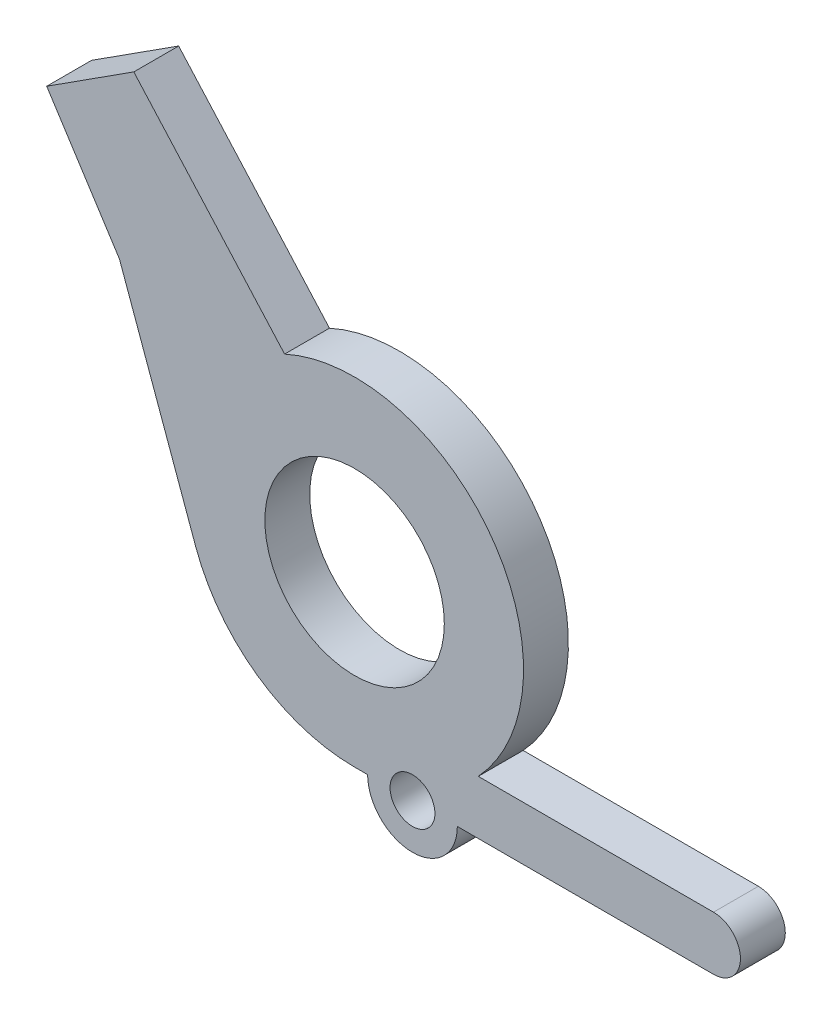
ISO-10303-21;
HEADER;
FILE_DESCRIPTION(('STEP AP214'),'2;1');
FILE_NAME('part.step','',(''),(''),'','','');
FILE_SCHEMA(('AUTOMOTIVE_DESIGN { 1 0 10303 214 1 1 1 1 }'));
ENDSEC;
DATA;
#1=APPLICATION_CONTEXT('core data for automotive mechanical design processes');
#2=APPLICATION_PROTOCOL_DEFINITION('international standard','automotive_design',2000,#1);
#3=PRODUCT_CONTEXT('',#1,'mechanical');
#4=PRODUCT('Part','Part','',(#3));
#5=PRODUCT_RELATED_PRODUCT_CATEGORY('part','',(#4));
#6=PRODUCT_DEFINITION_FORMATION('','',#4);
#7=PRODUCT_DEFINITION_CONTEXT('part definition',#1,'design');
#8=PRODUCT_DEFINITION('design','',#6,#7);
#9=PRODUCT_DEFINITION_SHAPE('','',#8);
#10=(LENGTH_UNIT() NAMED_UNIT(*) SI_UNIT(.MILLI.,.METRE.));
#11=(NAMED_UNIT(*) PLANE_ANGLE_UNIT() SI_UNIT($,.RADIAN.));
#12=(NAMED_UNIT(*) SI_UNIT($,.STERADIAN.) SOLID_ANGLE_UNIT());
#13=UNCERTAINTY_MEASURE_WITH_UNIT(LENGTH_MEASURE(1.E-05),#10,'distance_accuracy_value','');
#14=(GEOMETRIC_REPRESENTATION_CONTEXT(3) GLOBAL_UNCERTAINTY_ASSIGNED_CONTEXT((#13)) GLOBAL_UNIT_ASSIGNED_CONTEXT((#10,
#11,#12)) REPRESENTATION_CONTEXT('',''));
#15=CARTESIAN_POINT('',(0.,0.,0.));
#16=DIRECTION('',(0.,0.,1.));
#17=DIRECTION('',(1.,0.,0.));
#18=AXIS2_PLACEMENT_3D('',#15,#16,#17);
#19=CARTESIAN_POINT('',(0.,-3.76559487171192,1.));
#20=DIRECTION('',(0.,1.,0.));
#21=DIRECTION('',(0.,0.,1.));
#22=AXIS2_PLACEMENT_3D('',#19,#20,#21);
#23=PLANE('',#22);
#24=DIRECTION('',(1.,0.,0.));
#25=VECTOR('',#24,1.);
#26=CARTESIAN_POINT('',(0.,-3.76559487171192,0.));
#27=LINE('',#26,#25);
#28=CARTESIAN_POINT('',(0.,-3.76559487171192,0.));
#29=VERTEX_POINT('',#28);
#30=CARTESIAN_POINT('',(0.290132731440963,-3.76559487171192,0.));
#31=VERTEX_POINT('',#30);
#32=EDGE_CURVE('E124',#29,#31,#27,.T.);
#33=ORIENTED_EDGE('',*,*,#32,.T.);
#34=DIRECTION('',(0.,0.,1.));
#35=VECTOR('',#34,1.);
#36=CARTESIAN_POINT('',(0.290132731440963,-3.76559487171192,0.));
#37=LINE('',#36,#35);
#38=CARTESIAN_POINT('',(0.290132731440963,-3.76559487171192,1.));
#39=VERTEX_POINT('',#38);
#40=EDGE_CURVE('E11',#31,#39,#37,.T.);
#41=ORIENTED_EDGE('',*,*,#40,.T.);
#42=DIRECTION('',(1.,0.,0.));
#43=VECTOR('',#42,1.);
#44=CARTESIAN_POINT('',(0.,-3.76559487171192,1.));
#45=LINE('',#44,#43);
#46=CARTESIAN_POINT('',(0.,-3.76559487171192,1.));
#47=VERTEX_POINT('',#46);
#48=EDGE_CURVE('E123',#47,#39,#45,.T.);
#49=ORIENTED_EDGE('',*,*,#48,.F.);
#50=DIRECTION('',(0.,0.,-1.));
#51=VECTOR('',#50,1.);
#52=CARTESIAN_POINT('',(0.,-3.76559487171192,1.));
#53=LINE('',#52,#51);
#54=EDGE_CURVE('E172',#47,#29,#53,.T.);
#55=ORIENTED_EDGE('',*,*,#54,.T.);
#56=EDGE_LOOP('',(#33,#41,#49,#55));
#57=FACE_BOUND('',#56,.T.);
#58=ADVANCED_FACE('F32',(#57),#23,.F.);
#59=CARTESIAN_POINT('',(0.,0.,1.));
#60=DIRECTION('',(0.,0.,-1.));
#61=DIRECTION('',(-1.,0.,0.));
#62=AXIS2_PLACEMENT_3D('',#59,#60,#61);
#63=PLANE('',#62);
#64=CARTESIAN_POINT('',(1.29013273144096,-3.76559487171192,1.));
#65=DIRECTION('',(0.,0.,1.));
#66=DIRECTION('',(1.,0.,0.));
#67=AXIS2_PLACEMENT_3D('',#64,#65,#66);
#68=CIRCLE('',#67,0.5);
#69=CARTESIAN_POINT('',(1.79013273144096,-3.76559487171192,1.));
#70=VERTEX_POINT('',#69);
#71=EDGE_CURVE('E265',#70,#70,#68,.T.);
#72=ORIENTED_EDGE('',*,*,#71,.F.);
#73=EDGE_LOOP('',(#72));
#74=FACE_BOUND('',#73,.T.);
#75=ORIENTED_EDGE('',*,*,#48,.T.);
#76=CARTESIAN_POINT('',(1.29013273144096,-3.76559487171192,1.));
#77=DIRECTION('',(0.,0.,1.));
#78=DIRECTION('',(1.,0.,0.));
#79=AXIS2_PLACEMENT_3D('',#76,#77,#78);
#80=CIRCLE('',#79,1.);
#81=CARTESIAN_POINT('',(2.29013273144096,-3.76559487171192,1.));
#82=VERTEX_POINT('',#81);
#83=EDGE_CURVE('E47',#39,#82,#80,.T.);
#84=ORIENTED_EDGE('',*,*,#83,.T.);
#85=CARTESIAN_POINT('',(8.,-3.76559487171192,1.));
#86=VERTEX_POINT('',#85);
#87=EDGE_CURVE('E131',#82,#86,#45,.T.);
#88=ORIENTED_EDGE('',*,*,#87,.T.);
#89=CARTESIAN_POINT('',(8.,-3.16559487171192,1.));
#90=DIRECTION('',(0.,0.,1.));
#91=DIRECTION('',(1.,0.,0.));
#92=AXIS2_PLACEMENT_3D('',#89,#90,#91);
#93=CIRCLE('',#92,0.6);
#94=CARTESIAN_POINT('',(8.,-2.56559487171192,1.));
#95=VERTEX_POINT('',#94);
#96=EDGE_CURVE('E130',#86,#95,#93,.T.);
#97=ORIENTED_EDGE('',*,*,#96,.T.);
#98=DIRECTION('',(-1.,0.,0.));
#99=VECTOR('',#98,1.);
#100=CARTESIAN_POINT('',(2.75634317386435,-2.56559487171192,1.));
#101=LINE('',#100,#99);
#102=CARTESIAN_POINT('',(2.75634317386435,-2.56559487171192,1.));
#103=VERTEX_POINT('',#102);
#104=EDGE_CURVE('E133',#95,#103,#101,.T.);
#105=ORIENTED_EDGE('',*,*,#104,.T.);
#106=CARTESIAN_POINT('',(0.,0.,1.));
#107=DIRECTION('',(0.,0.,1.));
#108=DIRECTION('',(-1.,0.,0.));
#109=AXIS2_PLACEMENT_3D('',#106,#107,#108);
#110=CIRCLE('',#109,3.76559487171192);
#111=CARTESIAN_POINT('',(-1.56001258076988,3.42725334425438,1.));
#112=VERTEX_POINT('',#111);
#113=EDGE_CURVE('E139',#103,#112,#110,.T.);
#114=ORIENTED_EDGE('',*,*,#113,.T.);
#115=DIRECTION('',(-0.665865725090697,0.746071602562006,0.));
#116=VECTOR('',#115,1.);
#117=CARTESIAN_POINT('',(-4.92121240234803,7.19332155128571,1.));
#118=LINE('',#117,#116);
#119=CARTESIAN_POINT('',(-4.92121240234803,7.19332155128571,1.));
#120=VERTEX_POINT('',#119);
#121=EDGE_CURVE('E141',#112,#120,#118,.T.);
#122=ORIENTED_EDGE('',*,*,#121,.T.);
#123=DIRECTION('',(-0.841342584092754,-0.540502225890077,0.));
#124=VECTOR('',#123,1.);
#125=CARTESIAN_POINT('',(-6.86258924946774,5.94612626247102,1.));
#126=LINE('',#125,#124);
#127=CARTESIAN_POINT('',(-6.86258924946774,5.94612626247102,1.));
#128=VERTEX_POINT('',#127);
#129=EDGE_CURVE('E143',#120,#128,#126,.T.);
#130=ORIENTED_EDGE('',*,*,#129,.T.);
#131=DIRECTION('',(0.540502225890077,-0.841342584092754,0.));
#132=VECTOR('',#131,1.);
#133=CARTESIAN_POINT('',(-5.24108257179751,3.42209851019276,1.));
#134=LINE('',#133,#132);
#135=CARTESIAN_POINT('',(-5.24108257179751,3.42209851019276,1.));
#136=VERTEX_POINT('',#135);
#137=EDGE_CURVE('E145',#128,#136,#134,.T.);
#138=ORIENTED_EDGE('',*,*,#137,.T.);
#139=DIRECTION('',(0.339950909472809,-0.940443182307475,0.));
#140=VECTOR('',#139,1.);
#141=CARTESIAN_POINT('',(-3.54132802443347,-1.28011740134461,1.));
#142=LINE('',#141,#140);
#143=CARTESIAN_POINT('',(-3.54132802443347,-1.28011740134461,1.));
#144=VERTEX_POINT('',#143);
#145=EDGE_CURVE('E54',#136,#144,#142,.T.);
#146=ORIENTED_EDGE('',*,*,#145,.T.);
#147=CARTESIAN_POINT('',(0.,0.,1.));
#148=DIRECTION('',(0.,0.,1.));
#149=DIRECTION('',(-1.,0.,0.));
#150=AXIS2_PLACEMENT_3D('',#147,#148,#149);
#151=CIRCLE('',#150,3.76559487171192);
#152=EDGE_CURVE('E128',#144,#47,#151,.T.);
#153=ORIENTED_EDGE('',*,*,#152,.T.);
#154=EDGE_LOOP('',(#75,#84,#88,#97,#105,#114,#122,#130,#138,#146,#153));
#155=FACE_BOUND('',#154,.T.);
#156=CARTESIAN_POINT('',(0.,0.,1.));
#157=DIRECTION('',(0.,0.,1.));
#158=DIRECTION('',(1.,0.,0.));
#159=AXIS2_PLACEMENT_3D('',#156,#157,#158);
#160=CIRCLE('',#159,2.);
#161=CARTESIAN_POINT('',(2.,0.,1.));
#162=VERTEX_POINT('',#161);
#163=EDGE_CURVE('E187',#162,#162,#160,.T.);
#164=ORIENTED_EDGE('',*,*,#163,.F.);
#165=EDGE_LOOP('',(#164));
#166=FACE_BOUND('',#165,.T.);
#167=ADVANCED_FACE('F125',(#74,#155,#166),#63,.F.);
#168=CARTESIAN_POINT('',(0.,0.,0.));
#169=DIRECTION('',(0.,0.,-1.));
#170=DIRECTION('',(-1.,0.,0.));
#171=AXIS2_PLACEMENT_3D('',#168,#169,#170);
#172=PLANE('',#171);
#173=CARTESIAN_POINT('',(1.29013273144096,-3.76559487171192,0.));
#174=DIRECTION('',(0.,0.,1.));
#175=DIRECTION('',(1.,0.,0.));
#176=AXIS2_PLACEMENT_3D('',#173,#174,#175);
#177=CIRCLE('',#176,0.5);
#178=CARTESIAN_POINT('',(1.79013273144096,-3.76559487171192,0.));
#179=VERTEX_POINT('',#178);
#180=EDGE_CURVE('E118',#179,#179,#177,.T.);
#181=ORIENTED_EDGE('',*,*,#180,.T.);
#182=EDGE_LOOP('',(#181));
#183=FACE_BOUND('',#182,.T.);
#184=CARTESIAN_POINT('',(2.29013273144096,-3.76559487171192,0.));
#185=VERTEX_POINT('',#184);
#186=CARTESIAN_POINT('',(8.,-3.76559487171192,0.));
#187=VERTEX_POINT('',#186);
#188=EDGE_CURVE('E177',#185,#187,#27,.T.);
#189=ORIENTED_EDGE('',*,*,#188,.F.);
#190=CARTESIAN_POINT('',(1.29013273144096,-3.76559487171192,0.));
#191=DIRECTION('',(0.,0.,1.));
#192=DIRECTION('',(1.,0.,0.));
#193=AXIS2_PLACEMENT_3D('',#190,#191,#192);
#194=CIRCLE('',#193,1.);
#195=EDGE_CURVE('E117',#31,#185,#194,.T.);
#196=ORIENTED_EDGE('',*,*,#195,.F.);
#197=ORIENTED_EDGE('',*,*,#32,.F.);
#198=CARTESIAN_POINT('',(0.,0.,0.));
#199=DIRECTION('',(0.,0.,1.));
#200=DIRECTION('',(-1.,0.,0.));
#201=AXIS2_PLACEMENT_3D('',#198,#199,#200);
#202=CIRCLE('',#201,3.76559487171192);
#203=CARTESIAN_POINT('',(-3.54132802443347,-1.28011740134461,0.));
#204=VERTEX_POINT('',#203);
#205=EDGE_CURVE('E184',#204,#29,#202,.T.);
#206=ORIENTED_EDGE('',*,*,#205,.F.);
#207=DIRECTION('',(0.339950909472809,-0.940443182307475,0.));
#208=VECTOR('',#207,1.);
#209=CARTESIAN_POINT('',(-3.54132802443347,-1.28011740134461,0.));
#210=LINE('',#209,#208);
#211=CARTESIAN_POINT('',(-5.24108257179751,3.42209851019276,0.));
#212=VERTEX_POINT('',#211);
#213=EDGE_CURVE('E201',#212,#204,#210,.T.);
#214=ORIENTED_EDGE('',*,*,#213,.F.);
#215=DIRECTION('',(0.540502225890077,-0.841342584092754,0.));
#216=VECTOR('',#215,1.);
#217=CARTESIAN_POINT('',(-5.24108257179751,3.42209851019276,0.));
#218=LINE('',#217,#216);
#219=CARTESIAN_POINT('',(-6.86258924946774,5.94612626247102,0.));
#220=VERTEX_POINT('',#219);
#221=EDGE_CURVE('E200',#220,#212,#218,.T.);
#222=ORIENTED_EDGE('',*,*,#221,.F.);
#223=DIRECTION('',(-0.841342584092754,-0.540502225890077,0.));
#224=VECTOR('',#223,1.);
#225=CARTESIAN_POINT('',(-6.86258924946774,5.94612626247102,0.));
#226=LINE('',#225,#224);
#227=CARTESIAN_POINT('',(-4.92121240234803,7.19332155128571,0.));
#228=VERTEX_POINT('',#227);
#229=EDGE_CURVE('E198',#228,#220,#226,.T.);
#230=ORIENTED_EDGE('',*,*,#229,.F.);
#231=DIRECTION('',(-0.665865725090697,0.746071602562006,0.));
#232=VECTOR('',#231,1.);
#233=CARTESIAN_POINT('',(-4.92121240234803,7.19332155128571,0.));
#234=LINE('',#233,#232);
#235=CARTESIAN_POINT('',(-1.56001258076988,3.42725334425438,0.));
#236=VERTEX_POINT('',#235);
#237=EDGE_CURVE('E196',#236,#228,#234,.T.);
#238=ORIENTED_EDGE('',*,*,#237,.F.);
#239=CARTESIAN_POINT('',(0.,0.,0.));
#240=DIRECTION('',(0.,0.,1.));
#241=DIRECTION('',(-1.,0.,0.));
#242=AXIS2_PLACEMENT_3D('',#239,#240,#241);
#243=CIRCLE('',#242,3.76559487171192);
#244=CARTESIAN_POINT('',(2.75634317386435,-2.56559487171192,0.));
#245=VERTEX_POINT('',#244);
#246=EDGE_CURVE('E194',#245,#236,#243,.T.);
#247=ORIENTED_EDGE('',*,*,#246,.F.);
#248=DIRECTION('',(-1.,0.,0.));
#249=VECTOR('',#248,1.);
#250=CARTESIAN_POINT('',(2.75634317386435,-2.56559487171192,0.));
#251=LINE('',#250,#249);
#252=CARTESIAN_POINT('',(8.,-2.56559487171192,0.));
#253=VERTEX_POINT('',#252);
#254=EDGE_CURVE('E192',#253,#245,#251,.T.);
#255=ORIENTED_EDGE('',*,*,#254,.F.);
#256=CARTESIAN_POINT('',(8.,-3.16559487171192,0.));
#257=DIRECTION('',(0.,0.,1.));
#258=DIRECTION('',(1.,0.,0.));
#259=AXIS2_PLACEMENT_3D('',#256,#257,#258);
#260=CIRCLE('',#259,0.6);
#261=EDGE_CURVE('E183',#187,#253,#260,.T.);
#262=ORIENTED_EDGE('',*,*,#261,.F.);
#263=EDGE_LOOP('',(#189,#196,#197,#206,#214,#222,#230,#238,#247,#255,#262));
#264=FACE_BOUND('',#263,.T.);
#265=CARTESIAN_POINT('',(0.,0.,0.));
#266=DIRECTION('',(0.,0.,1.));
#267=DIRECTION('',(1.,0.,0.));
#268=AXIS2_PLACEMENT_3D('',#265,#266,#267);
#269=CIRCLE('',#268,2.);
#270=CARTESIAN_POINT('',(2.,0.,0.));
#271=VERTEX_POINT('',#270);
#272=EDGE_CURVE('E270',#271,#271,#269,.T.);
#273=ORIENTED_EDGE('',*,*,#272,.T.);
#274=EDGE_LOOP('',(#273));
#275=FACE_BOUND('',#274,.T.);
#276=ADVANCED_FACE('F180',(#183,#264,#275),#172,.T.);
#277=CARTESIAN_POINT('',(0.,0.,1.));
#278=DIRECTION('',(0.,0.,-1.));
#279=DIRECTION('',(-1.,0.,0.));
#280=AXIS2_PLACEMENT_3D('',#277,#278,#279);
#281=CYLINDRICAL_SURFACE('',#280,3.76559487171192);
#282=ORIENTED_EDGE('',*,*,#205,.T.);
#283=ORIENTED_EDGE('',*,*,#54,.F.);
#284=ORIENTED_EDGE('',*,*,#152,.F.);
#285=DIRECTION('',(0.,0.,-1.));
#286=VECTOR('',#285,1.);
#287=CARTESIAN_POINT('',(-3.54132802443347,-1.28011740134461,1.));
#288=LINE('',#287,#286);
#289=EDGE_CURVE('E148',#144,#204,#288,.T.);
#290=ORIENTED_EDGE('',*,*,#289,.T.);
#291=EDGE_LOOP('',(#282,#283,#284,#290));
#292=FACE_BOUND('',#291,.T.);
#293=ADVANCED_FACE('F34',(#292),#281,.T.);
#294=ORIENTED_EDGE('',*,*,#87,.F.);
#295=DIRECTION('',(0.,0.,1.));
#296=VECTOR('',#295,1.);
#297=CARTESIAN_POINT('',(2.29013273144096,-3.76559487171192,0.));
#298=LINE('',#297,#296);
#299=EDGE_CURVE('E40',#82,#185,#298,.F.);
#300=ORIENTED_EDGE('',*,*,#299,.T.);
#301=ORIENTED_EDGE('',*,*,#188,.T.);
#302=DIRECTION('',(0.,0.,-1.));
#303=VECTOR('',#302,1.);
#304=CARTESIAN_POINT('',(8.,-3.76559487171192,1.));
#305=LINE('',#304,#303);
#306=EDGE_CURVE('E169',#86,#187,#305,.T.);
#307=ORIENTED_EDGE('',*,*,#306,.F.);
#308=EDGE_LOOP('',(#294,#300,#301,#307));
#309=FACE_BOUND('',#308,.T.);
#310=ADVANCED_FACE('F175',(#309),#23,.F.);
#311=CARTESIAN_POINT('',(8.,-3.16559487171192,1.));
#312=DIRECTION('',(0.,0.,-1.));
#313=DIRECTION('',(-1.,0.,0.));
#314=AXIS2_PLACEMENT_3D('',#311,#312,#313);
#315=CYLINDRICAL_SURFACE('',#314,0.6);
#316=ORIENTED_EDGE('',*,*,#261,.T.);
#317=DIRECTION('',(0.,0.,-1.));
#318=VECTOR('',#317,1.);
#319=CARTESIAN_POINT('',(8.,-2.56559487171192,1.));
#320=LINE('',#319,#318);
#321=EDGE_CURVE('E166',#95,#253,#320,.T.);
#322=ORIENTED_EDGE('',*,*,#321,.F.);
#323=ORIENTED_EDGE('',*,*,#96,.F.);
#324=ORIENTED_EDGE('',*,*,#306,.T.);
#325=EDGE_LOOP('',(#316,#322,#323,#324));
#326=FACE_BOUND('',#325,.T.);
#327=ADVANCED_FACE('F214',(#326),#315,.T.);
#328=CARTESIAN_POINT('',(2.75634317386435,-2.56559487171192,1.));
#329=DIRECTION('',(0.,-1.,0.));
#330=DIRECTION('',(1.,0.,0.));
#331=AXIS2_PLACEMENT_3D('',#328,#329,#330);
#332=PLANE('',#331);
#333=ORIENTED_EDGE('',*,*,#254,.T.);
#334=DIRECTION('',(0.,0.,-1.));
#335=VECTOR('',#334,1.);
#336=CARTESIAN_POINT('',(2.75634317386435,-2.56559487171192,1.));
#337=LINE('',#336,#335);
#338=EDGE_CURVE('E163',#103,#245,#337,.T.);
#339=ORIENTED_EDGE('',*,*,#338,.F.);
#340=ORIENTED_EDGE('',*,*,#104,.F.);
#341=ORIENTED_EDGE('',*,*,#321,.T.);
#342=EDGE_LOOP('',(#333,#339,#340,#341));
#343=FACE_BOUND('',#342,.T.);
#344=ADVANCED_FACE('F226',(#343),#332,.F.);
#345=CARTESIAN_POINT('',(0.,0.,1.));
#346=DIRECTION('',(0.,0.,-1.));
#347=DIRECTION('',(-1.,0.,0.));
#348=AXIS2_PLACEMENT_3D('',#345,#346,#347);
#349=CYLINDRICAL_SURFACE('',#348,3.76559487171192);
#350=ORIENTED_EDGE('',*,*,#246,.T.);
#351=DIRECTION('',(0.,0.,-1.));
#352=VECTOR('',#351,1.);
#353=CARTESIAN_POINT('',(-1.56001258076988,3.42725334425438,1.));
#354=LINE('',#353,#352);
#355=EDGE_CURVE('E160',#112,#236,#354,.T.);
#356=ORIENTED_EDGE('',*,*,#355,.F.);
#357=ORIENTED_EDGE('',*,*,#113,.F.);
#358=ORIENTED_EDGE('',*,*,#338,.T.);
#359=EDGE_LOOP('',(#350,#356,#357,#358));
#360=FACE_BOUND('',#359,.T.);
#361=ADVANCED_FACE('F230',(#360),#349,.T.);
#362=CARTESIAN_POINT('',(-4.92121240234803,7.19332155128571,1.));
#363=DIRECTION('',(-0.746071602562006,-0.665865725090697,0.));
#364=DIRECTION('',(0.665865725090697,-0.746071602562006,0.));
#365=AXIS2_PLACEMENT_3D('',#362,#363,#364);
#366=PLANE('',#365);
#367=ORIENTED_EDGE('',*,*,#237,.T.);
#368=DIRECTION('',(0.,0.,-1.));
#369=VECTOR('',#368,1.);
#370=CARTESIAN_POINT('',(-4.92121240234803,7.19332155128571,1.));
#371=LINE('',#370,#369);
#372=EDGE_CURVE('E157',#120,#228,#371,.T.);
#373=ORIENTED_EDGE('',*,*,#372,.F.);
#374=ORIENTED_EDGE('',*,*,#121,.F.);
#375=ORIENTED_EDGE('',*,*,#355,.T.);
#376=EDGE_LOOP('',(#367,#373,#374,#375));
#377=FACE_BOUND('',#376,.T.);
#378=ADVANCED_FACE('F234',(#377),#366,.F.);
#379=CARTESIAN_POINT('',(-6.86258924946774,5.94612626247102,1.));
#380=DIRECTION('',(0.540502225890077,-0.841342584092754,0.));
#381=DIRECTION('',(0.841342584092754,0.540502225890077,0.));
#382=AXIS2_PLACEMENT_3D('',#379,#380,#381);
#383=PLANE('',#382);
#384=ORIENTED_EDGE('',*,*,#229,.T.);
#385=DIRECTION('',(0.,0.,-1.));
#386=VECTOR('',#385,1.);
#387=CARTESIAN_POINT('',(-6.86258924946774,5.94612626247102,1.));
#388=LINE('',#387,#386);
#389=EDGE_CURVE('E154',#128,#220,#388,.T.);
#390=ORIENTED_EDGE('',*,*,#389,.F.);
#391=ORIENTED_EDGE('',*,*,#129,.F.);
#392=ORIENTED_EDGE('',*,*,#372,.T.);
#393=EDGE_LOOP('',(#384,#390,#391,#392));
#394=FACE_BOUND('',#393,.T.);
#395=ADVANCED_FACE('F238',(#394),#383,.F.);
#396=CARTESIAN_POINT('',(-5.24108257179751,3.42209851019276,1.));
#397=DIRECTION('',(0.841342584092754,0.540502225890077,0.));
#398=DIRECTION('',(-0.540502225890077,0.841342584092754,0.));
#399=AXIS2_PLACEMENT_3D('',#396,#397,#398);
#400=PLANE('',#399);
#401=ORIENTED_EDGE('',*,*,#221,.T.);
#402=DIRECTION('',(0.,0.,-1.));
#403=VECTOR('',#402,1.);
#404=CARTESIAN_POINT('',(-5.24108257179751,3.42209851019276,1.));
#405=LINE('',#404,#403);
#406=EDGE_CURVE('E151',#136,#212,#405,.T.);
#407=ORIENTED_EDGE('',*,*,#406,.F.);
#408=ORIENTED_EDGE('',*,*,#137,.F.);
#409=ORIENTED_EDGE('',*,*,#389,.T.);
#410=EDGE_LOOP('',(#401,#407,#408,#409));
#411=FACE_BOUND('',#410,.T.);
#412=ADVANCED_FACE('F242',(#411),#400,.F.);
#413=CARTESIAN_POINT('',(-3.54132802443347,-1.28011740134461,1.));
#414=DIRECTION('',(0.940443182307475,0.339950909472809,0.));
#415=DIRECTION('',(-0.339950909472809,0.940443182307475,0.));
#416=AXIS2_PLACEMENT_3D('',#413,#414,#415);
#417=PLANE('',#416);
#418=ORIENTED_EDGE('',*,*,#213,.T.);
#419=ORIENTED_EDGE('',*,*,#289,.F.);
#420=ORIENTED_EDGE('',*,*,#145,.F.);
#421=ORIENTED_EDGE('',*,*,#406,.T.);
#422=EDGE_LOOP('',(#418,#419,#420,#421));
#423=FACE_BOUND('',#422,.T.);
#424=ADVANCED_FACE('F204',(#423),#417,.F.);
#425=CARTESIAN_POINT('',(0.,0.,1.));
#426=DIRECTION('',(0.,0.,-1.));
#427=DIRECTION('',(-1.,0.,0.));
#428=AXIS2_PLACEMENT_3D('',#425,#426,#427);
#429=CYLINDRICAL_SURFACE('',#428,2.);
#430=ORIENTED_EDGE('',*,*,#163,.T.);
#431=EDGE_LOOP('',(#430));
#432=FACE_BOUND('',#431,.T.);
#433=ORIENTED_EDGE('',*,*,#272,.F.);
#434=EDGE_LOOP('',(#433));
#435=FACE_BOUND('',#434,.T.);
#436=ADVANCED_FACE('F248',(#432,#435),#429,.F.);
#437=CARTESIAN_POINT('',(1.29013273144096,-3.76559487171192,0.));
#438=DIRECTION('',(0.,0.,1.));
#439=DIRECTION('',(1.,0.,0.));
#440=AXIS2_PLACEMENT_3D('',#437,#438,#439);
#441=CYLINDRICAL_SURFACE('',#440,1.);
#442=ORIENTED_EDGE('',*,*,#40,.F.);
#443=ORIENTED_EDGE('',*,*,#195,.T.);
#444=ORIENTED_EDGE('',*,*,#299,.F.);
#445=ORIENTED_EDGE('',*,*,#83,.F.);
#446=EDGE_LOOP('',(#442,#443,#444,#445));
#447=FACE_BOUND('',#446,.T.);
#448=ADVANCED_FACE('F113',(#447),#441,.T.);
#449=CARTESIAN_POINT('',(1.29013273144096,-3.76559487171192,0.));
#450=DIRECTION('',(0.,0.,1.));
#451=DIRECTION('',(1.,0.,0.));
#452=AXIS2_PLACEMENT_3D('',#449,#450,#451);
#453=CYLINDRICAL_SURFACE('',#452,0.5);
#454=ORIENTED_EDGE('',*,*,#180,.F.);
#455=EDGE_LOOP('',(#454));
#456=FACE_BOUND('',#455,.T.);
#457=ORIENTED_EDGE('',*,*,#71,.T.);
#458=EDGE_LOOP('',(#457));
#459=FACE_BOUND('',#458,.T.);
#460=ADVANCED_FACE('F255',(#456,#459),#453,.F.);
#461=CLOSED_SHELL('',(#58,#167,#276,#293,#310,#327,#344,#361,#378,#395,#412,#424,#436,#448,#460));
#462=MANIFOLD_SOLID_BREP('B2',#461);
#463=ADVANCED_BREP_SHAPE_REPRESENTATION('',(#18,#462),#14);
#464=SHAPE_DEFINITION_REPRESENTATION(#9,#463);
ENDSEC;
END-ISO-10303-21;
